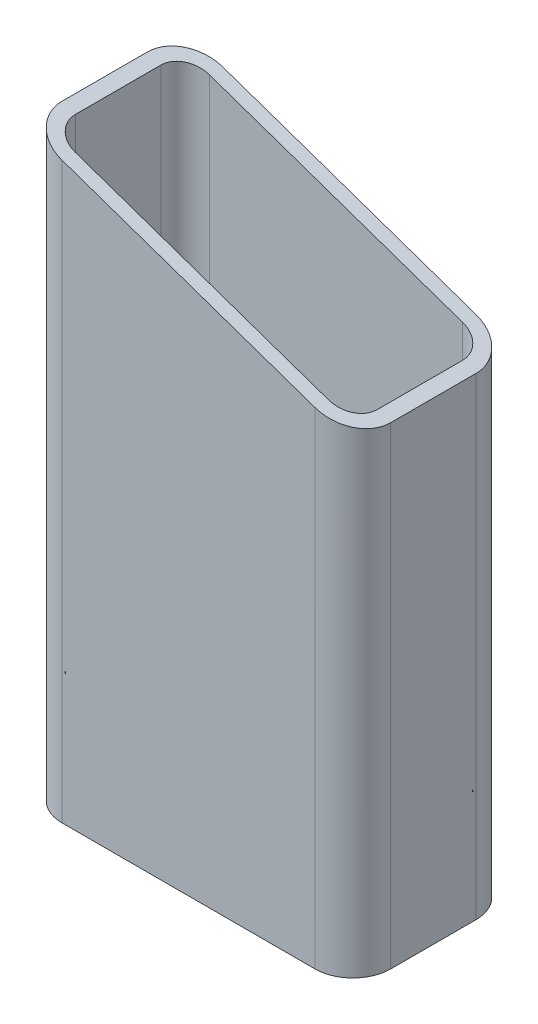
from build123d import *

# Parameters (mm, degrees)
SALIENTE_EXTRUIR1_DEPTH = 350
CORTAR_EXTRUIR1_DEPTH   = 376.925524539


with BuildPart() as part:
    # Croquis2 → Saliente-Extruir1 (new body)
    with BuildSketch(Plane(origin=(0, 0, 0), x_dir=(1, 0, 0), z_dir=(0, 1, 0))):
        with BuildLine():
            ThreePointArc((98, -25.5), (91.409902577, -41.409902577), (75.5, -48))
            Line((75.5, -48), (-75.5, -48))
            ThreePointArc((-75.5, -48), (-91.409902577, -41.409902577), (-98, -25.5))
            Line((-98, -25.5), (-98, 25.5))
            ThreePointArc((-98, 25.5), (-91.409902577, 41.409902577), (-75.5, 48))
            Line((-75.5, 48), (75.5, 48))
            ThreePointArc((75.5, 48), (91.409902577, 41.409902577), (98, 25.5))
            Line((98, 25.5), (98, -25.5))
        make_face()
        with BuildLine():
            Line((90, 25.5), (90, -25.5))
            ThreePointArc((90, -25.5), (85.753048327, -35.753048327), (75.5, -40))
            Line((75.5, -40), (-75.5, -40))
            ThreePointArc((-75.5, -40), (-85.753048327, -35.753048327), (-90, -25.5))
            Line((-90, -25.5), (-90, 25.5))
            ThreePointArc((-90, 25.5), (-85.753048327, 35.753048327), (-75.5, 40))
            Line((-75.5, 40), (75.5, 40))
            ThreePointArc((75.5, 40), (85.753048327, 35.753048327), (90, 25.5))
        make_face(mode=Mode.SUBTRACT)
    extrude(amount=SALIENTE_EXTRUIR1_DEPTH)

    # Croquis3 → Cortar-Extruir1 (cut, through all)
    with BuildSketch(Plane.XY.offset(48)):
        Polygon((-98, 350), (98, 282.062771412), (98, 350), align=None)
    extrude(amount=-CORTAR_EXTRUIR1_DEPTH, mode=Mode.SUBTRACT)


solid = part.part
